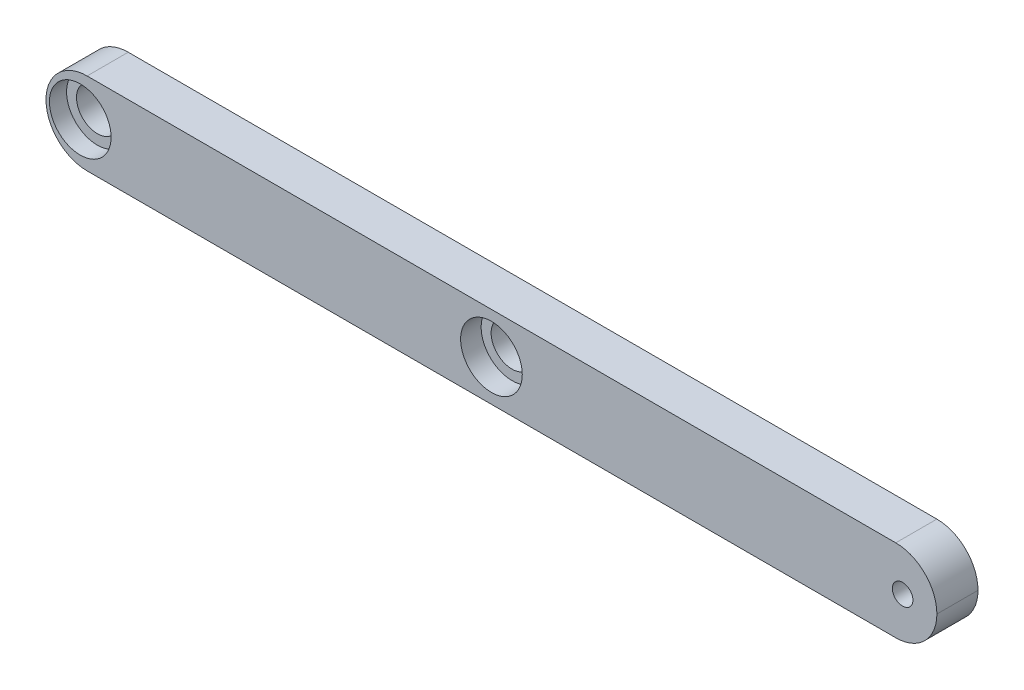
ISO-10303-21;
HEADER;
FILE_DESCRIPTION(('STEP AP214'),'2;1');
FILE_NAME('part.step','',(''),(''),'','','');
FILE_SCHEMA(('AUTOMOTIVE_DESIGN { 1 0 10303 214 1 1 1 1 }'));
ENDSEC;
DATA;
#1=APPLICATION_CONTEXT('core data for automotive mechanical design processes');
#2=APPLICATION_PROTOCOL_DEFINITION('international standard','automotive_design',2000,#1);
#3=PRODUCT_CONTEXT('',#1,'mechanical');
#4=PRODUCT('Part','Part','',(#3));
#5=PRODUCT_RELATED_PRODUCT_CATEGORY('part','',(#4));
#6=PRODUCT_DEFINITION_FORMATION('','',#4);
#7=PRODUCT_DEFINITION_CONTEXT('part definition',#1,'design');
#8=PRODUCT_DEFINITION('design','',#6,#7);
#9=PRODUCT_DEFINITION_SHAPE('','',#8);
#10=(LENGTH_UNIT() NAMED_UNIT(*) SI_UNIT(.MILLI.,.METRE.));
#11=(NAMED_UNIT(*) PLANE_ANGLE_UNIT() SI_UNIT($,.RADIAN.));
#12=(NAMED_UNIT(*) SI_UNIT($,.STERADIAN.) SOLID_ANGLE_UNIT());
#13=UNCERTAINTY_MEASURE_WITH_UNIT(LENGTH_MEASURE(1.E-05),#10,'distance_accuracy_value','');
#14=(GEOMETRIC_REPRESENTATION_CONTEXT(3) GLOBAL_UNCERTAINTY_ASSIGNED_CONTEXT((#13)) GLOBAL_UNIT_ASSIGNED_CONTEXT((#10,
#11,#12)) REPRESENTATION_CONTEXT('',''));
#15=CARTESIAN_POINT('',(0.,0.,0.));
#16=DIRECTION('',(0.,0.,1.));
#17=DIRECTION('',(1.,0.,0.));
#18=AXIS2_PLACEMENT_3D('',#15,#16,#17);
#19=CARTESIAN_POINT('',(-64.6389728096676,6.23957703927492,0.));
#20=DIRECTION('',(0.,0.,1.));
#21=DIRECTION('',(1.,0.,0.));
#22=AXIS2_PLACEMENT_3D('',#19,#20,#21);
#23=CYLINDRICAL_SURFACE('',#22,3.05);
#24=CARTESIAN_POINT('',(-64.6389728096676,6.23957703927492,0.));
#25=DIRECTION('',(0.,0.,1.));
#26=DIRECTION('',(1.,0.,0.));
#27=AXIS2_PLACEMENT_3D('',#24,#25,#26);
#28=CIRCLE('',#27,3.05);
#29=CARTESIAN_POINT('',(-61.5889728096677,6.23957703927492,0.));
#30=VERTEX_POINT('',#29);
#31=EDGE_CURVE('E156',#30,#30,#28,.T.);
#32=ORIENTED_EDGE('',*,*,#31,.F.);
#33=EDGE_LOOP('',(#32));
#34=FACE_BOUND('',#33,.T.);
#35=CARTESIAN_POINT('',(-64.6389728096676,6.23957703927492,3.5));
#36=DIRECTION('',(0.,0.,1.));
#37=DIRECTION('',(1.,0.,0.));
#38=AXIS2_PLACEMENT_3D('',#35,#36,#37);
#39=CIRCLE('',#38,3.05);
#40=CARTESIAN_POINT('',(-61.5889728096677,6.23957703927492,3.5));
#41=VERTEX_POINT('',#40);
#42=EDGE_CURVE('E36',#41,#41,#39,.F.);
#43=ORIENTED_EDGE('',*,*,#42,.F.);
#44=EDGE_LOOP('',(#43));
#45=FACE_BOUND('',#44,.T.);
#46=ADVANCED_FACE('F32',(#34,#45),#23,.F.);
#47=CARTESIAN_POINT('',(-4.63897280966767,6.23957703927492,0.));
#48=DIRECTION('',(0.,0.,1.));
#49=DIRECTION('',(1.,0.,0.));
#50=AXIS2_PLACEMENT_3D('',#47,#48,#49);
#51=CYLINDRICAL_SURFACE('',#50,3.05);
#52=CARTESIAN_POINT('',(-4.63897280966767,6.23957703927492,0.));
#53=DIRECTION('',(0.,0.,1.));
#54=DIRECTION('',(1.,0.,0.));
#55=AXIS2_PLACEMENT_3D('',#52,#53,#54);
#56=CIRCLE('',#55,3.05);
#57=CARTESIAN_POINT('',(-1.58897280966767,6.23957703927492,0.));
#58=VERTEX_POINT('',#57);
#59=EDGE_CURVE('E153',#58,#58,#56,.T.);
#60=ORIENTED_EDGE('',*,*,#59,.F.);
#61=EDGE_LOOP('',(#60));
#62=FACE_BOUND('',#61,.T.);
#63=CARTESIAN_POINT('',(-4.63897280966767,6.23957703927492,3.));
#64=DIRECTION('',(0.,0.,1.));
#65=DIRECTION('',(1.,0.,0.));
#66=AXIS2_PLACEMENT_3D('',#63,#64,#65);
#67=CIRCLE('',#66,3.05);
#68=CARTESIAN_POINT('',(-1.58897280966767,6.23957703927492,3.));
#69=VERTEX_POINT('',#68);
#70=EDGE_CURVE('E135',#69,#69,#67,.F.);
#71=ORIENTED_EDGE('',*,*,#70,.F.);
#72=EDGE_LOOP('',(#71));
#73=FACE_BOUND('',#72,.T.);
#74=ADVANCED_FACE('F189',(#62,#73),#51,.F.);
#75=CARTESIAN_POINT('',(-69.6389728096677,0.239577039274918,6.));
#76=DIRECTION('',(0.,1.,0.));
#77=DIRECTION('',(0.,0.,1.));
#78=AXIS2_PLACEMENT_3D('',#75,#76,#77);
#79=PLANE('',#78);
#80=DIRECTION('',(1.,0.,0.));
#81=VECTOR('',#80,1.);
#82=CARTESIAN_POINT('',(-69.6389728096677,0.239577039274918,6.));
#83=LINE('',#82,#81);
#84=CARTESIAN_POINT('',(-63.6389728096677,0.239577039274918,6.));
#85=VERTEX_POINT('',#84);
#86=CARTESIAN_POINT('',(54.3610271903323,0.239577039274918,6.));
#87=VERTEX_POINT('',#86);
#88=EDGE_CURVE('E105',#85,#87,#83,.T.);
#89=ORIENTED_EDGE('',*,*,#88,.F.);
#90=DIRECTION('',(0.,0.,-1.));
#91=VECTOR('',#90,1.);
#92=CARTESIAN_POINT('',(-63.6389728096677,0.239577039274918,6.));
#93=LINE('',#92,#91);
#94=CARTESIAN_POINT('',(-63.6389728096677,0.239577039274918,0.));
#95=VERTEX_POINT('',#94);
#96=EDGE_CURVE('E90',#85,#95,#93,.T.);
#97=ORIENTED_EDGE('',*,*,#96,.T.);
#98=DIRECTION('',(1.,0.,0.));
#99=VECTOR('',#98,1.);
#100=CARTESIAN_POINT('',(-69.6389728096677,0.239577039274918,0.));
#101=LINE('',#100,#99);
#102=CARTESIAN_POINT('',(54.3610271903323,0.239577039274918,0.));
#103=VERTEX_POINT('',#102);
#104=EDGE_CURVE('E102',#95,#103,#101,.T.);
#105=ORIENTED_EDGE('',*,*,#104,.T.);
#106=DIRECTION('',(0.,0.,-1.));
#107=VECTOR('',#106,1.);
#108=CARTESIAN_POINT('',(54.3610271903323,0.239577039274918,6.));
#109=LINE('',#108,#107);
#110=EDGE_CURVE('E107',#103,#87,#109,.F.);
#111=ORIENTED_EDGE('',*,*,#110,.T.);
#112=EDGE_LOOP('',(#89,#97,#105,#111));
#113=FACE_BOUND('',#112,.T.);
#114=ADVANCED_FACE('F34',(#113),#79,.F.);
#115=CARTESIAN_POINT('',(-69.6389728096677,12.2395770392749,6.));
#116=DIRECTION('',(0.,-1.,0.));
#117=DIRECTION('',(0.,0.,-1.));
#118=AXIS2_PLACEMENT_3D('',#115,#116,#117);
#119=PLANE('',#118);
#120=DIRECTION('',(-1.,0.,0.));
#121=VECTOR('',#120,1.);
#122=CARTESIAN_POINT('',(-69.6389728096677,12.2395770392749,0.));
#123=LINE('',#122,#121);
#124=CARTESIAN_POINT('',(54.3610271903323,12.2395770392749,0.));
#125=VERTEX_POINT('',#124);
#126=CARTESIAN_POINT('',(-63.6389728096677,12.2395770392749,0.));
#127=VERTEX_POINT('',#126);
#128=EDGE_CURVE('E111',#125,#127,#123,.T.);
#129=ORIENTED_EDGE('',*,*,#128,.T.);
#130=DIRECTION('',(0.,0.,-1.));
#131=VECTOR('',#130,1.);
#132=CARTESIAN_POINT('',(-63.6389728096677,12.2395770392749,6.));
#133=LINE('',#132,#131);
#134=CARTESIAN_POINT('',(-63.6389728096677,12.2395770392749,6.));
#135=VERTEX_POINT('',#134);
#136=EDGE_CURVE('E11',#127,#135,#133,.F.);
#137=ORIENTED_EDGE('',*,*,#136,.T.);
#138=DIRECTION('',(-1.,0.,0.));
#139=VECTOR('',#138,1.);
#140=CARTESIAN_POINT('',(-69.6389728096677,12.2395770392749,6.));
#141=LINE('',#140,#139);
#142=CARTESIAN_POINT('',(54.3610271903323,12.2395770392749,6.));
#143=VERTEX_POINT('',#142);
#144=EDGE_CURVE('E121',#143,#135,#141,.T.);
#145=ORIENTED_EDGE('',*,*,#144,.F.);
#146=DIRECTION('',(0.,0.,-1.));
#147=VECTOR('',#146,1.);
#148=CARTESIAN_POINT('',(54.3610271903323,12.2395770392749,6.));
#149=LINE('',#148,#147);
#150=EDGE_CURVE('E41',#143,#125,#149,.T.);
#151=ORIENTED_EDGE('',*,*,#150,.T.);
#152=EDGE_LOOP('',(#129,#137,#145,#151));
#153=FACE_BOUND('',#152,.T.);
#154=ADVANCED_FACE('F165',(#153),#119,.F.);
#155=CARTESIAN_POINT('',(-69.6389728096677,0.239577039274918,6.));
#156=DIRECTION('',(0.,0.,1.));
#157=DIRECTION('',(1.,0.,0.));
#158=AXIS2_PLACEMENT_3D('',#155,#156,#157);
#159=PLANE('',#158);
#160=CARTESIAN_POINT('',(-64.6389728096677,6.23957703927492,6.));
#161=DIRECTION('',(0.,0.,1.));
#162=DIRECTION('',(1.,0.,0.));
#163=AXIS2_PLACEMENT_3D('',#160,#161,#162);
#164=CIRCLE('',#163,4.5);
#165=CARTESIAN_POINT('',(-60.1389728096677,6.23957703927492,6.));
#166=VERTEX_POINT('',#165);
#167=EDGE_CURVE('E342',#166,#166,#164,.T.);
#168=ORIENTED_EDGE('',*,*,#167,.F.);
#169=EDGE_LOOP('',(#168));
#170=FACE_BOUND('',#169,.T.);
#171=CARTESIAN_POINT('',(-4.63897280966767,6.23957703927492,6.));
#172=DIRECTION('',(0.,0.,1.));
#173=DIRECTION('',(1.,0.,0.));
#174=AXIS2_PLACEMENT_3D('',#171,#172,#173);
#175=CIRCLE('',#174,4.5);
#176=CARTESIAN_POINT('',(-0.138972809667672,6.23957703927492,6.));
#177=VERTEX_POINT('',#176);
#178=EDGE_CURVE('E144',#177,#177,#175,.T.);
#179=ORIENTED_EDGE('',*,*,#178,.F.);
#180=EDGE_LOOP('',(#179));
#181=FACE_BOUND('',#180,.T.);
#182=CARTESIAN_POINT('',(55.3610271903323,6.23957703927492,6.));
#183=DIRECTION('',(0.,0.,1.));
#184=DIRECTION('',(1.,0.,0.));
#185=AXIS2_PLACEMENT_3D('',#182,#183,#184);
#186=CIRCLE('',#185,1.5);
#187=CARTESIAN_POINT('',(56.8610271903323,6.23957703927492,6.));
#188=VERTEX_POINT('',#187);
#189=EDGE_CURVE('E116',#188,#188,#186,.T.);
#190=ORIENTED_EDGE('',*,*,#189,.F.);
#191=EDGE_LOOP('',(#190));
#192=FACE_BOUND('',#191,.T.);
#193=CARTESIAN_POINT('',(-63.6389728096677,6.23957703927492,6.));
#194=DIRECTION('',(0.,0.,1.));
#195=DIRECTION('',(1.,0.,0.));
#196=AXIS2_PLACEMENT_3D('',#193,#194,#195);
#197=CIRCLE('',#196,6.);
#198=CARTESIAN_POINT('',(-69.6389728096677,6.23957703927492,6.));
#199=VERTEX_POINT('',#198);
#200=EDGE_CURVE('E130',#135,#199,#197,.T.);
#201=ORIENTED_EDGE('',*,*,#200,.T.);
#202=CARTESIAN_POINT('',(-63.6389728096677,6.23957703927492,6.));
#203=DIRECTION('',(0.,0.,1.));
#204=DIRECTION('',(1.,0.,0.));
#205=AXIS2_PLACEMENT_3D('',#202,#203,#204);
#206=CIRCLE('',#205,6.);
#207=EDGE_CURVE('E132',#199,#85,#206,.T.);
#208=ORIENTED_EDGE('',*,*,#207,.T.);
#209=ORIENTED_EDGE('',*,*,#88,.T.);
#210=CARTESIAN_POINT('',(54.3610271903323,6.23957703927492,6.));
#211=DIRECTION('',(0.,0.,1.));
#212=DIRECTION('',(1.,0.,0.));
#213=AXIS2_PLACEMENT_3D('',#210,#211,#212);
#214=CIRCLE('',#213,6.);
#215=CARTESIAN_POINT('',(60.3610271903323,6.23957703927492,6.));
#216=VERTEX_POINT('',#215);
#217=EDGE_CURVE('E96',#87,#216,#214,.T.);
#218=ORIENTED_EDGE('',*,*,#217,.T.);
#219=CARTESIAN_POINT('',(54.3610271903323,6.23957703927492,6.));
#220=DIRECTION('',(0.,0.,1.));
#221=DIRECTION('',(1.,0.,0.));
#222=AXIS2_PLACEMENT_3D('',#219,#220,#221);
#223=CIRCLE('',#222,6.);
#224=EDGE_CURVE('E54',#216,#143,#223,.T.);
#225=ORIENTED_EDGE('',*,*,#224,.T.);
#226=ORIENTED_EDGE('',*,*,#144,.T.);
#227=EDGE_LOOP('',(#201,#208,#209,#218,#225,#226));
#228=FACE_BOUND('',#227,.T.);
#229=ADVANCED_FACE('F163',(#170,#181,#192,#228),#159,.T.);
#230=CARTESIAN_POINT('',(-69.6389728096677,0.239577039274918,0.));
#231=DIRECTION('',(0.,0.,1.));
#232=DIRECTION('',(1.,0.,0.));
#233=AXIS2_PLACEMENT_3D('',#230,#231,#232);
#234=PLANE('',#233);
#235=ORIENTED_EDGE('',*,*,#59,.T.);
#236=EDGE_LOOP('',(#235));
#237=FACE_BOUND('',#236,.T.);
#238=ORIENTED_EDGE('',*,*,#31,.T.);
#239=EDGE_LOOP('',(#238));
#240=FACE_BOUND('',#239,.T.);
#241=CARTESIAN_POINT('',(55.3610271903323,6.23957703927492,0.));
#242=DIRECTION('',(0.,0.,1.));
#243=DIRECTION('',(1.,0.,0.));
#244=AXIS2_PLACEMENT_3D('',#241,#242,#243);
#245=CIRCLE('',#244,1.5);
#246=CARTESIAN_POINT('',(56.8610271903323,6.23957703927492,0.));
#247=VERTEX_POINT('',#246);
#248=EDGE_CURVE('E112',#247,#247,#245,.T.);
#249=ORIENTED_EDGE('',*,*,#248,.T.);
#250=EDGE_LOOP('',(#249));
#251=FACE_BOUND('',#250,.T.);
#252=ORIENTED_EDGE('',*,*,#104,.F.);
#253=CARTESIAN_POINT('',(-63.6389728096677,6.23957703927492,0.));
#254=DIRECTION('',(0.,0.,1.));
#255=DIRECTION('',(1.,0.,0.));
#256=AXIS2_PLACEMENT_3D('',#253,#254,#255);
#257=CIRCLE('',#256,6.);
#258=CARTESIAN_POINT('',(-69.6389728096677,6.23957703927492,0.));
#259=VERTEX_POINT('',#258);
#260=EDGE_CURVE('E86',#95,#259,#257,.F.);
#261=ORIENTED_EDGE('',*,*,#260,.T.);
#262=CARTESIAN_POINT('',(-63.6389728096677,6.23957703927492,0.));
#263=DIRECTION('',(0.,0.,1.));
#264=DIRECTION('',(1.,0.,0.));
#265=AXIS2_PLACEMENT_3D('',#262,#263,#264);
#266=CIRCLE('',#265,6.);
#267=EDGE_CURVE('E97',#259,#127,#266,.F.);
#268=ORIENTED_EDGE('',*,*,#267,.T.);
#269=ORIENTED_EDGE('',*,*,#128,.F.);
#270=CARTESIAN_POINT('',(54.3610271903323,6.23957703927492,0.));
#271=DIRECTION('',(0.,0.,1.));
#272=DIRECTION('',(1.,0.,0.));
#273=AXIS2_PLACEMENT_3D('',#270,#271,#272);
#274=CIRCLE('',#273,6.);
#275=CARTESIAN_POINT('',(60.3610271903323,6.23957703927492,0.));
#276=VERTEX_POINT('',#275);
#277=EDGE_CURVE('E125',#125,#276,#274,.F.);
#278=ORIENTED_EDGE('',*,*,#277,.T.);
#279=CARTESIAN_POINT('',(54.3610271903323,6.23957703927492,0.));
#280=DIRECTION('',(0.,0.,1.));
#281=DIRECTION('',(1.,0.,0.));
#282=AXIS2_PLACEMENT_3D('',#279,#280,#281);
#283=CIRCLE('',#282,6.);
#284=EDGE_CURVE('E106',#276,#103,#283,.F.);
#285=ORIENTED_EDGE('',*,*,#284,.T.);
#286=EDGE_LOOP('',(#252,#261,#268,#269,#278,#285));
#287=FACE_BOUND('',#286,.T.);
#288=ADVANCED_FACE('F109',(#237,#240,#251,#287),#234,.F.);
#289=CARTESIAN_POINT('',(55.3610271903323,6.23957703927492,0.));
#290=DIRECTION('',(0.,0.,1.));
#291=DIRECTION('',(1.,0.,0.));
#292=AXIS2_PLACEMENT_3D('',#289,#290,#291);
#293=CYLINDRICAL_SURFACE('',#292,1.5);
#294=ORIENTED_EDGE('',*,*,#248,.F.);
#295=EDGE_LOOP('',(#294));
#296=FACE_BOUND('',#295,.T.);
#297=ORIENTED_EDGE('',*,*,#189,.T.);
#298=EDGE_LOOP('',(#297));
#299=FACE_BOUND('',#298,.T.);
#300=ADVANCED_FACE('F161',(#296,#299),#293,.F.);
#301=CARTESIAN_POINT('',(-63.6389728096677,6.23957703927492,6.));
#302=DIRECTION('',(0.,0.,-1.));
#303=DIRECTION('',(-1.,0.,0.));
#304=AXIS2_PLACEMENT_3D('',#301,#302,#303);
#305=CYLINDRICAL_SURFACE('',#304,6.);
#306=DIRECTION('',(0.,0.,-1.));
#307=VECTOR('',#306,1.);
#308=CARTESIAN_POINT('',(-69.6389728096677,6.23957703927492,6.));
#309=LINE('',#308,#307);
#310=EDGE_CURVE('E92',#199,#259,#309,.T.);
#311=ORIENTED_EDGE('',*,*,#310,.F.);
#312=ORIENTED_EDGE('',*,*,#200,.F.);
#313=ORIENTED_EDGE('',*,*,#136,.F.);
#314=ORIENTED_EDGE('',*,*,#267,.F.);
#315=EDGE_LOOP('',(#311,#312,#313,#314));
#316=FACE_BOUND('',#315,.T.);
#317=ADVANCED_FACE('F170',(#316),#305,.T.);
#318=CARTESIAN_POINT('',(-63.6389728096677,6.23957703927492,6.));
#319=DIRECTION('',(0.,0.,-1.));
#320=DIRECTION('',(-1.,0.,0.));
#321=AXIS2_PLACEMENT_3D('',#318,#319,#320);
#322=CYLINDRICAL_SURFACE('',#321,6.);
#323=ORIENTED_EDGE('',*,*,#207,.F.);
#324=ORIENTED_EDGE('',*,*,#310,.T.);
#325=ORIENTED_EDGE('',*,*,#260,.F.);
#326=ORIENTED_EDGE('',*,*,#96,.F.);
#327=EDGE_LOOP('',(#323,#324,#325,#326));
#328=FACE_BOUND('',#327,.T.);
#329=ADVANCED_FACE('F89',(#328),#322,.T.);
#330=CARTESIAN_POINT('',(54.3610271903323,6.23957703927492,6.));
#331=DIRECTION('',(0.,0.,-1.));
#332=DIRECTION('',(-1.,0.,0.));
#333=AXIS2_PLACEMENT_3D('',#330,#331,#332);
#334=CYLINDRICAL_SURFACE('',#333,6.);
#335=DIRECTION('',(0.,0.,-1.));
#336=VECTOR('',#335,1.);
#337=CARTESIAN_POINT('',(60.3610271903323,6.23957703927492,6.));
#338=LINE('',#337,#336);
#339=EDGE_CURVE('E137',#216,#276,#338,.T.);
#340=ORIENTED_EDGE('',*,*,#339,.F.);
#341=ORIENTED_EDGE('',*,*,#217,.F.);
#342=ORIENTED_EDGE('',*,*,#110,.F.);
#343=ORIENTED_EDGE('',*,*,#284,.F.);
#344=EDGE_LOOP('',(#340,#341,#342,#343));
#345=FACE_BOUND('',#344,.T.);
#346=ADVANCED_FACE('F177',(#345),#334,.T.);
#347=CARTESIAN_POINT('',(54.3610271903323,6.23957703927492,6.));
#348=DIRECTION('',(0.,0.,-1.));
#349=DIRECTION('',(-1.,0.,0.));
#350=AXIS2_PLACEMENT_3D('',#347,#348,#349);
#351=CYLINDRICAL_SURFACE('',#350,6.);
#352=ORIENTED_EDGE('',*,*,#224,.F.);
#353=ORIENTED_EDGE('',*,*,#339,.T.);
#354=ORIENTED_EDGE('',*,*,#277,.F.);
#355=ORIENTED_EDGE('',*,*,#150,.F.);
#356=EDGE_LOOP('',(#352,#353,#354,#355));
#357=FACE_BOUND('',#356,.T.);
#358=ADVANCED_FACE('F174',(#357),#351,.T.);
#359=CARTESIAN_POINT('',(-4.63897280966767,6.23957703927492,3.));
#360=DIRECTION('',(0.,0.,1.));
#361=DIRECTION('',(1.,0.,0.));
#362=AXIS2_PLACEMENT_3D('',#359,#360,#361);
#363=PLANE('',#362);
#364=CARTESIAN_POINT('',(-4.63897280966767,6.23957703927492,3.));
#365=DIRECTION('',(0.,0.,1.));
#366=DIRECTION('',(1.,0.,0.));
#367=AXIS2_PLACEMENT_3D('',#364,#365,#366);
#368=CIRCLE('',#367,4.5);
#369=CARTESIAN_POINT('',(-0.138972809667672,6.23957703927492,3.));
#370=VERTEX_POINT('',#369);
#371=EDGE_CURVE('E138',#370,#370,#368,.T.);
#372=ORIENTED_EDGE('',*,*,#371,.T.);
#373=EDGE_LOOP('',(#372));
#374=FACE_BOUND('',#373,.T.);
#375=ORIENTED_EDGE('',*,*,#70,.T.);
#376=EDGE_LOOP('',(#375));
#377=FACE_BOUND('',#376,.T.);
#378=ADVANCED_FACE('F185',(#374,#377),#363,.T.);
#379=CARTESIAN_POINT('',(-4.63897280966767,6.23957703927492,3.));
#380=DIRECTION('',(0.,0.,1.));
#381=DIRECTION('',(1.,0.,0.));
#382=AXIS2_PLACEMENT_3D('',#379,#380,#381);
#383=CYLINDRICAL_SURFACE('',#382,4.5);
#384=ORIENTED_EDGE('',*,*,#371,.F.);
#385=EDGE_LOOP('',(#384));
#386=FACE_BOUND('',#385,.T.);
#387=ORIENTED_EDGE('',*,*,#178,.T.);
#388=EDGE_LOOP('',(#387));
#389=FACE_BOUND('',#388,.T.);
#390=ADVANCED_FACE('F232',(#386,#389),#383,.F.);
#391=CARTESIAN_POINT('',(-64.6389728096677,6.23957703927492,3.5));
#392=DIRECTION('',(0.,0.,1.));
#393=DIRECTION('',(1.,0.,0.));
#394=AXIS2_PLACEMENT_3D('',#391,#392,#393);
#395=PLANE('',#394);
#396=CARTESIAN_POINT('',(-64.6389728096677,6.23957703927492,3.5));
#397=DIRECTION('',(0.,0.,1.));
#398=DIRECTION('',(1.,0.,0.));
#399=AXIS2_PLACEMENT_3D('',#396,#397,#398);
#400=CIRCLE('',#399,4.5);
#401=CARTESIAN_POINT('',(-60.1389728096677,6.23957703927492,3.5));
#402=VERTEX_POINT('',#401);
#403=EDGE_CURVE('E339',#402,#402,#400,.T.);
#404=ORIENTED_EDGE('',*,*,#403,.T.);
#405=EDGE_LOOP('',(#404));
#406=FACE_BOUND('',#405,.T.);
#407=ORIENTED_EDGE('',*,*,#42,.T.);
#408=EDGE_LOOP('',(#407));
#409=FACE_BOUND('',#408,.T.);
#410=ADVANCED_FACE('F245',(#406,#409),#395,.T.);
#411=CARTESIAN_POINT('',(-64.6389728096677,6.23957703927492,3.5));
#412=DIRECTION('',(0.,0.,1.));
#413=DIRECTION('',(1.,0.,0.));
#414=AXIS2_PLACEMENT_3D('',#411,#412,#413);
#415=CYLINDRICAL_SURFACE('',#414,4.5);
#416=ORIENTED_EDGE('',*,*,#403,.F.);
#417=EDGE_LOOP('',(#416));
#418=FACE_BOUND('',#417,.T.);
#419=ORIENTED_EDGE('',*,*,#167,.T.);
#420=EDGE_LOOP('',(#419));
#421=FACE_BOUND('',#420,.T.);
#422=ADVANCED_FACE('F249',(#418,#421),#415,.F.);
#423=CLOSED_SHELL('',(#46,#74,#114,#154,#229,#288,#300,#317,#329,#346,#358,#378,#390,#410,#422));
#424=MANIFOLD_SOLID_BREP('B2',#423);
#425=ADVANCED_BREP_SHAPE_REPRESENTATION('',(#18,#424),#14);
#426=SHAPE_DEFINITION_REPRESENTATION(#9,#425);
ENDSEC;
END-ISO-10303-21;
